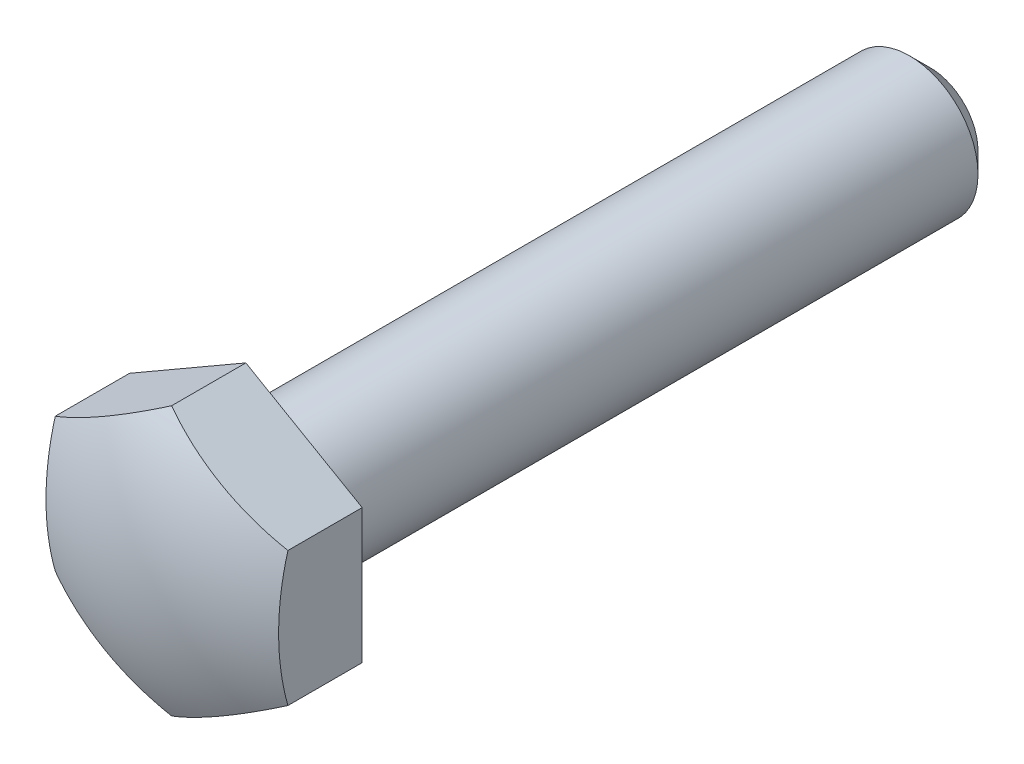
ISO-10303-21;
HEADER;
FILE_DESCRIPTION(('STEP AP214'),'2;1');
FILE_NAME('part.step','',(''),(''),'','','');
FILE_SCHEMA(('AUTOMOTIVE_DESIGN { 1 0 10303 214 1 1 1 1 }'));
ENDSEC;
DATA;
#1=APPLICATION_CONTEXT('core data for automotive mechanical design processes');
#2=APPLICATION_PROTOCOL_DEFINITION('international standard','automotive_design',2000,#1);
#3=PRODUCT_CONTEXT('',#1,'mechanical');
#4=PRODUCT('Part','Part','',(#3));
#5=PRODUCT_RELATED_PRODUCT_CATEGORY('part','',(#4));
#6=PRODUCT_DEFINITION_FORMATION('','',#4);
#7=PRODUCT_DEFINITION_CONTEXT('part definition',#1,'design');
#8=PRODUCT_DEFINITION('design','',#6,#7);
#9=PRODUCT_DEFINITION_SHAPE('','',#8);
#10=(LENGTH_UNIT() NAMED_UNIT(*) SI_UNIT(.MILLI.,.METRE.));
#11=(NAMED_UNIT(*) PLANE_ANGLE_UNIT() SI_UNIT($,.RADIAN.));
#12=(NAMED_UNIT(*) SI_UNIT($,.STERADIAN.) SOLID_ANGLE_UNIT());
#13=UNCERTAINTY_MEASURE_WITH_UNIT(LENGTH_MEASURE(1.E-05),#10,'distance_accuracy_value','');
#14=(GEOMETRIC_REPRESENTATION_CONTEXT(3) GLOBAL_UNCERTAINTY_ASSIGNED_CONTEXT((#13)) GLOBAL_UNIT_ASSIGNED_CONTEXT((#10,
#11,#12)) REPRESENTATION_CONTEXT('',''));
#15=CARTESIAN_POINT('',(0.,0.,0.));
#16=DIRECTION('',(0.,0.,1.));
#17=DIRECTION('',(1.,0.,0.));
#18=AXIS2_PLACEMENT_3D('',#15,#16,#17);
#19=CARTESIAN_POINT('',(5.,0.,0.));
#20=DIRECTION('',(0.,0.,1.));
#21=DIRECTION('',(1.,0.,0.));
#22=AXIS2_PLACEMENT_3D('',#19,#20,#21);
#23=PLANE('',#22);
#24=CARTESIAN_POINT('',(0.,0.,0.));
#25=DIRECTION('',(0.,0.,1.));
#26=DIRECTION('',(1.,0.,0.));
#27=AXIS2_PLACEMENT_3D('',#24,#25,#26);
#28=CIRCLE('',#27,5.);
#29=CARTESIAN_POINT('',(5.,0.,0.));
#30=VERTEX_POINT('',#29);
#31=EDGE_CURVE('E115',#30,#30,#28,.T.);
#32=ORIENTED_EDGE('',*,*,#31,.T.);
#33=EDGE_LOOP('',(#32));
#34=FACE_BOUND('',#33,.T.);
#35=DIRECTION('',(-0.86602540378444,-0.5,0.));
#36=VECTOR('',#35,1.);
#37=CARTESIAN_POINT('',(8.5,-4.90747728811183,0.));
#38=LINE('',#37,#36);
#39=CARTESIAN_POINT('',(8.5,-4.90747728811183,0.));
#40=VERTEX_POINT('',#39);
#41=CARTESIAN_POINT('',(0.,-9.81495457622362,0.));
#42=VERTEX_POINT('',#41);
#43=EDGE_CURVE('E89',#40,#42,#38,.T.);
#44=ORIENTED_EDGE('',*,*,#43,.T.);
#45=DIRECTION('',(0.86602540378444,-0.5,0.));
#46=VECTOR('',#45,1.);
#47=CARTESIAN_POINT('',(-8.5,-4.90747728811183,0.));
#48=LINE('',#47,#46);
#49=CARTESIAN_POINT('',(-8.5,-4.90747728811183,0.));
#50=VERTEX_POINT('',#49);
#51=EDGE_CURVE('E87',#50,#42,#48,.T.);
#52=ORIENTED_EDGE('',*,*,#51,.F.);
#53=DIRECTION('',(0.,-1.,0.));
#54=VECTOR('',#53,1.);
#55=CARTESIAN_POINT('',(-8.5,4.9074772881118,0.));
#56=LINE('',#55,#54);
#57=CARTESIAN_POINT('',(-8.5,4.9074772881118,0.));
#58=VERTEX_POINT('',#57);
#59=EDGE_CURVE('E37',#58,#50,#56,.T.);
#60=ORIENTED_EDGE('',*,*,#59,.F.);
#61=DIRECTION('',(0.866025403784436,0.5,0.));
#62=VECTOR('',#61,1.);
#63=CARTESIAN_POINT('',(-8.5,4.9074772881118,0.));
#64=LINE('',#63,#62);
#65=CARTESIAN_POINT('',(0.,9.81495457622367,0.));
#66=VERTEX_POINT('',#65);
#67=EDGE_CURVE('E77',#58,#66,#64,.T.);
#68=ORIENTED_EDGE('',*,*,#67,.T.);
#69=DIRECTION('',(-0.866025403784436,0.5,0.));
#70=VECTOR('',#69,1.);
#71=CARTESIAN_POINT('',(8.5,4.90747728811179,0.));
#72=LINE('',#71,#70);
#73=CARTESIAN_POINT('',(8.5,4.90747728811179,0.));
#74=VERTEX_POINT('',#73);
#75=EDGE_CURVE('E83',#74,#66,#72,.T.);
#76=ORIENTED_EDGE('',*,*,#75,.F.);
#77=DIRECTION('',(0.,-1.,0.));
#78=VECTOR('',#77,1.);
#79=CARTESIAN_POINT('',(8.5,4.90747728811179,0.));
#80=LINE('',#79,#78);
#81=EDGE_CURVE('E95',#74,#40,#80,.T.);
#82=ORIENTED_EDGE('',*,*,#81,.T.);
#83=EDGE_LOOP('',(#44,#52,#60,#68,#76,#82));
#84=FACE_BOUND('',#83,.T.);
#85=ADVANCED_FACE('F14',(#34,#84),#23,.F.);
#86=CARTESIAN_POINT('',(0.,0.,10.));
#87=DIRECTION('',(0.,0.,1.));
#88=DIRECTION('',(1.,0.,0.));
#89=AXIS2_PLACEMENT_3D('',#86,#87,#88);
#90=CYLINDRICAL_SURFACE('',#89,5.);
#91=CARTESIAN_POINT('',(0.,0.,-48.5));
#92=DIRECTION('',(0.,0.,1.));
#93=DIRECTION('',(1.,0.,0.));
#94=AXIS2_PLACEMENT_3D('',#91,#92,#93);
#95=CIRCLE('',#94,5.);
#96=CARTESIAN_POINT('',(5.,0.,-48.5));
#97=VERTEX_POINT('',#96);
#98=EDGE_CURVE('E22',#97,#97,#95,.T.);
#99=ORIENTED_EDGE('',*,*,#98,.T.);
#100=EDGE_LOOP('',(#99));
#101=FACE_BOUND('',#100,.T.);
#102=ORIENTED_EDGE('',*,*,#31,.F.);
#103=EDGE_LOOP('',(#102));
#104=FACE_BOUND('',#103,.T.);
#105=ADVANCED_FACE('F120',(#101,#104),#90,.T.);
#106=CARTESIAN_POINT('',(0.,0.,-50.));
#107=DIRECTION('',(0.,0.,1.));
#108=DIRECTION('',(1.,0.,0.));
#109=AXIS2_PLACEMENT_3D('',#106,#107,#108);
#110=PLANE('',#109);
#111=CARTESIAN_POINT('',(0.,0.,-50.));
#112=DIRECTION('',(0.,0.,1.));
#113=DIRECTION('',(1.,0.,0.));
#114=AXIS2_PLACEMENT_3D('',#111,#112,#113);
#115=CIRCLE('',#114,3.5);
#116=CARTESIAN_POINT('',(3.5,0.,-50.));
#117=VERTEX_POINT('',#116);
#118=EDGE_CURVE('E9',#117,#117,#115,.F.);
#119=ORIENTED_EDGE('',*,*,#118,.T.);
#120=EDGE_LOOP('',(#119));
#121=FACE_BOUND('',#120,.T.);
#122=ADVANCED_FACE('F139',(#121),#110,.F.);
#123=CARTESIAN_POINT('',(8.5,-4.90747728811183,8.));
#124=DIRECTION('',(0.5,-0.86602540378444,0.));
#125=DIRECTION('',(0.86602540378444,0.5,0.));
#126=AXIS2_PLACEMENT_3D('',#123,#124,#125);
#127=PLANE('',#126);
#128=DIRECTION('',(0.,0.,-1.));
#129=VECTOR('',#128,1.);
#130=CARTESIAN_POINT('',(0.,-9.81495457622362,8.));
#131=LINE('',#130,#129);
#132=CARTESIAN_POINT('',(0.,-9.81495457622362,5.426034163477));
#133=VERTEX_POINT('',#132);
#134=EDGE_CURVE('E29',#133,#42,#131,.T.);
#135=ORIENTED_EDGE('',*,*,#134,.T.);
#136=ORIENTED_EDGE('',*,*,#43,.F.);
#137=DIRECTION('',(0.,0.,-1.));
#138=VECTOR('',#137,1.);
#139=CARTESIAN_POINT('',(8.5,-4.90747728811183,8.));
#140=LINE('',#139,#138);
#141=CARTESIAN_POINT('',(8.5,-4.90747728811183,5.426034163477));
#142=VERTEX_POINT('',#141);
#143=EDGE_CURVE('E100',#142,#40,#140,.T.);
#144=ORIENTED_EDGE('',*,*,#143,.F.);
#145=CARTESIAN_POINT('',(4.25,-7.36121593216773,-12.));
#146=DIRECTION('',(0.5,-0.86602540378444,0.));
#147=DIRECTION('',(0.86602540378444,0.5,0.));
#148=AXIS2_PLACEMENT_3D('',#145,#146,#147);
#149=CIRCLE('',#148,18.1038669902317);
#150=EDGE_CURVE('E112',#133,#142,#149,.F.);
#151=ORIENTED_EDGE('',*,*,#150,.F.);
#152=EDGE_LOOP('',(#135,#136,#144,#151));
#153=FACE_BOUND('',#152,.T.);
#154=ADVANCED_FACE('F144',(#153),#127,.T.);
#155=CARTESIAN_POINT('',(8.5,4.90747728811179,8.));
#156=DIRECTION('',(1.,0.,0.));
#157=DIRECTION('',(0.,0.,-1.));
#158=AXIS2_PLACEMENT_3D('',#155,#156,#157);
#159=PLANE('',#158);
#160=ORIENTED_EDGE('',*,*,#143,.T.);
#161=ORIENTED_EDGE('',*,*,#81,.F.);
#162=DIRECTION('',(0.,0.,-1.));
#163=VECTOR('',#162,1.);
#164=CARTESIAN_POINT('',(8.5,4.90747728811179,8.));
#165=LINE('',#164,#163);
#166=CARTESIAN_POINT('',(8.5,4.90747728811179,5.426034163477));
#167=VERTEX_POINT('',#166);
#168=EDGE_CURVE('E98',#167,#74,#165,.T.);
#169=ORIENTED_EDGE('',*,*,#168,.F.);
#170=CARTESIAN_POINT('',(8.5,0.,-12.));
#171=DIRECTION('',(1.,0.,0.));
#172=DIRECTION('',(0.,0.,-1.));
#173=AXIS2_PLACEMENT_3D('',#170,#171,#172);
#174=CIRCLE('',#173,18.1038669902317);
#175=EDGE_CURVE('E109',#142,#167,#174,.F.);
#176=ORIENTED_EDGE('',*,*,#175,.F.);
#177=EDGE_LOOP('',(#160,#161,#169,#176));
#178=FACE_BOUND('',#177,.T.);
#179=ADVANCED_FACE('F146',(#178),#159,.T.);
#180=CARTESIAN_POINT('',(8.5,4.90747728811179,8.));
#181=DIRECTION('',(-0.5,-0.866025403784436,0.));
#182=DIRECTION('',(0.866025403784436,-0.5,0.));
#183=AXIS2_PLACEMENT_3D('',#180,#181,#182);
#184=PLANE('',#183);
#185=CARTESIAN_POINT('',(4.25,7.36121593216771,-12.));
#186=DIRECTION('',(-0.5,-0.866025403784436,0.));
#187=DIRECTION('',(0.866025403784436,-0.5,0.));
#188=AXIS2_PLACEMENT_3D('',#185,#186,#187);
#189=CIRCLE('',#188,18.1038669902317);
#190=CARTESIAN_POINT('',(0.,9.81495457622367,5.426034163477));
#191=VERTEX_POINT('',#190);
#192=EDGE_CURVE('E107',#191,#167,#189,.F.);
#193=ORIENTED_EDGE('',*,*,#192,.T.);
#194=ORIENTED_EDGE('',*,*,#168,.T.);
#195=ORIENTED_EDGE('',*,*,#75,.T.);
#196=DIRECTION('',(0.,0.,-1.));
#197=VECTOR('',#196,1.);
#198=CARTESIAN_POINT('',(0.,9.81495457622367,8.));
#199=LINE('',#198,#197);
#200=EDGE_CURVE('E73',#191,#66,#199,.T.);
#201=ORIENTED_EDGE('',*,*,#200,.F.);
#202=EDGE_LOOP('',(#193,#194,#195,#201));
#203=FACE_BOUND('',#202,.T.);
#204=ADVANCED_FACE('F149',(#203),#184,.F.);
#205=CARTESIAN_POINT('',(-8.5,4.9074772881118,8.));
#206=DIRECTION('',(-0.5,0.866025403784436,0.));
#207=DIRECTION('',(-0.866025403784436,-0.5,0.));
#208=AXIS2_PLACEMENT_3D('',#205,#206,#207);
#209=PLANE('',#208);
#210=ORIENTED_EDGE('',*,*,#200,.T.);
#211=ORIENTED_EDGE('',*,*,#67,.F.);
#212=DIRECTION('',(0.,0.,-1.));
#213=VECTOR('',#212,1.);
#214=CARTESIAN_POINT('',(-8.5,4.9074772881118,8.));
#215=LINE('',#214,#213);
#216=CARTESIAN_POINT('',(-8.5,4.9074772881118,5.426034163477));
#217=VERTEX_POINT('',#216);
#218=EDGE_CURVE('E66',#217,#58,#215,.T.);
#219=ORIENTED_EDGE('',*,*,#218,.F.);
#220=CARTESIAN_POINT('',(-4.25,7.36121593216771,-12.));
#221=DIRECTION('',(-0.5,0.866025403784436,0.));
#222=DIRECTION('',(-0.866025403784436,-0.5,0.));
#223=AXIS2_PLACEMENT_3D('',#220,#221,#222);
#224=CIRCLE('',#223,18.1038669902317);
#225=EDGE_CURVE('E105',#191,#217,#224,.F.);
#226=ORIENTED_EDGE('',*,*,#225,.F.);
#227=EDGE_LOOP('',(#210,#211,#219,#226));
#228=FACE_BOUND('',#227,.T.);
#229=ADVANCED_FACE('F78',(#228),#209,.T.);
#230=CARTESIAN_POINT('',(-8.5,4.9074772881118,8.));
#231=DIRECTION('',(1.,0.,0.));
#232=DIRECTION('',(0.,1.,0.));
#233=AXIS2_PLACEMENT_3D('',#230,#231,#232);
#234=PLANE('',#233);
#235=CARTESIAN_POINT('',(-8.5,0.,-12.));
#236=DIRECTION('',(1.,0.,0.));
#237=DIRECTION('',(0.,1.,0.));
#238=AXIS2_PLACEMENT_3D('',#235,#236,#237);
#239=CIRCLE('',#238,18.1038669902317);
#240=CARTESIAN_POINT('',(-8.5,-4.90747728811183,5.426034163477));
#241=VERTEX_POINT('',#240);
#242=EDGE_CURVE('E70',#241,#217,#239,.F.);
#243=ORIENTED_EDGE('',*,*,#242,.T.);
#244=ORIENTED_EDGE('',*,*,#218,.T.);
#245=ORIENTED_EDGE('',*,*,#59,.T.);
#246=DIRECTION('',(0.,0.,-1.));
#247=VECTOR('',#246,1.);
#248=CARTESIAN_POINT('',(-8.5,-4.90747728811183,8.));
#249=LINE('',#248,#247);
#250=EDGE_CURVE('E74',#241,#50,#249,.T.);
#251=ORIENTED_EDGE('',*,*,#250,.F.);
#252=EDGE_LOOP('',(#243,#244,#245,#251));
#253=FACE_BOUND('',#252,.T.);
#254=ADVANCED_FACE('F68',(#253),#234,.F.);
#255=CARTESIAN_POINT('',(-8.5,-4.90747728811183,8.));
#256=DIRECTION('',(0.5,0.86602540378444,0.));
#257=DIRECTION('',(-0.86602540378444,0.5,0.));
#258=AXIS2_PLACEMENT_3D('',#255,#256,#257);
#259=PLANE('',#258);
#260=CARTESIAN_POINT('',(-4.25,-7.36121593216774,-12.));
#261=DIRECTION('',(0.5,0.86602540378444,0.));
#262=DIRECTION('',(-0.86602540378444,0.5,0.));
#263=AXIS2_PLACEMENT_3D('',#260,#261,#262);
#264=CIRCLE('',#263,18.1038669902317);
#265=EDGE_CURVE('E102',#133,#241,#264,.F.);
#266=ORIENTED_EDGE('',*,*,#265,.T.);
#267=ORIENTED_EDGE('',*,*,#250,.T.);
#268=ORIENTED_EDGE('',*,*,#51,.T.);
#269=ORIENTED_EDGE('',*,*,#134,.F.);
#270=EDGE_LOOP('',(#266,#267,#268,#269));
#271=FACE_BOUND('',#270,.T.);
#272=ADVANCED_FACE('F130',(#271),#259,.F.);
#273=CARTESIAN_POINT('',(0.,0.,-12.));
#274=DIRECTION('',(0.,0.,1.));
#275=DIRECTION('',(1.,0.,0.));
#276=AXIS2_PLACEMENT_3D('',#273,#274,#275);
#277=SPHERICAL_SURFACE('',#276,20.);
#278=ORIENTED_EDGE('',*,*,#265,.F.);
#279=ORIENTED_EDGE('',*,*,#150,.T.);
#280=ORIENTED_EDGE('',*,*,#175,.T.);
#281=ORIENTED_EDGE('',*,*,#192,.F.);
#282=ORIENTED_EDGE('',*,*,#225,.T.);
#283=ORIENTED_EDGE('',*,*,#242,.F.);
#284=EDGE_LOOP('',(#278,#279,#280,#281,#282,#283));
#285=FACE_BOUND('',#284,.T.);
#286=ADVANCED_FACE('F124',(#285),#277,.T.);
#287=CARTESIAN_POINT('',(0.,0.,-48.5));
#288=DIRECTION('',(0.,0.,1.));
#289=DIRECTION('',(1.,0.,0.));
#290=AXIS2_PLACEMENT_3D('',#287,#288,#289);
#291=CONICAL_SURFACE('',#290,5.,0.785398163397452);
#292=ORIENTED_EDGE('',*,*,#118,.F.);
#293=EDGE_LOOP('',(#292));
#294=FACE_BOUND('',#293,.T.);
#295=ORIENTED_EDGE('',*,*,#98,.F.);
#296=EDGE_LOOP('',(#295));
#297=FACE_BOUND('',#296,.T.);
#298=ADVANCED_FACE('F16',(#294,#297),#291,.T.);
#299=CLOSED_SHELL('',(#85,#105,#122,#154,#179,#204,#229,#254,#272,#286,#298));
#300=MANIFOLD_SOLID_BREP('B1',#299);
#301=ADVANCED_BREP_SHAPE_REPRESENTATION('',(#18,#300),#14);
#302=SHAPE_DEFINITION_REPRESENTATION(#9,#301);
ENDSEC;
END-ISO-10303-21;
